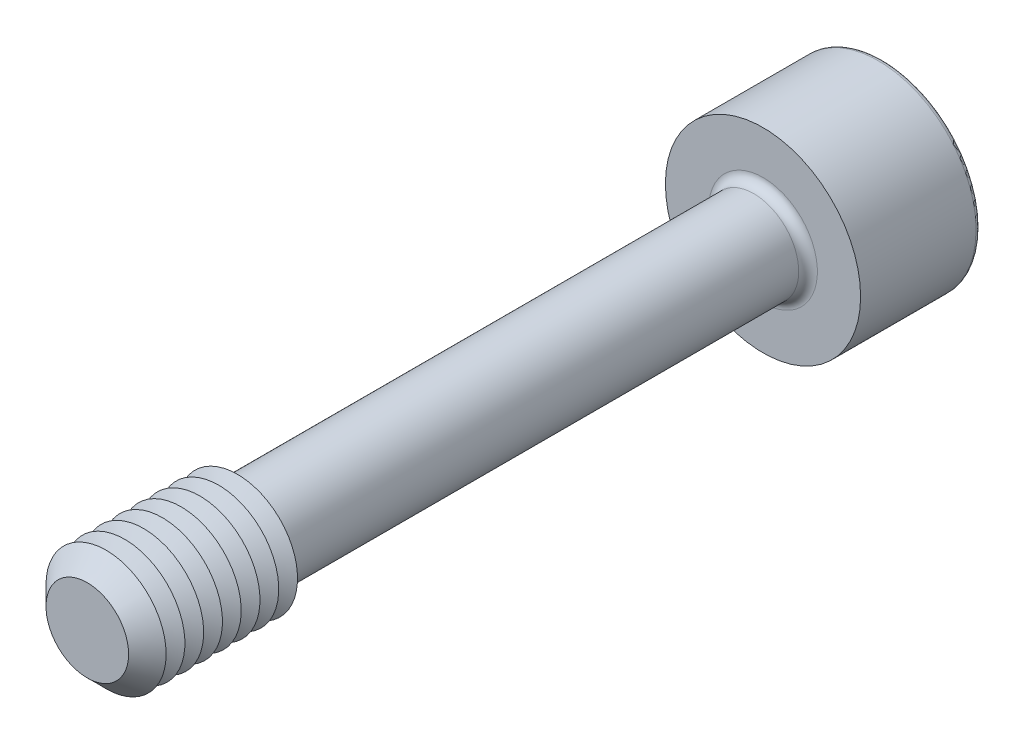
ISO-10303-21;
HEADER;
FILE_DESCRIPTION(('STEP AP214'),'2;1');
FILE_NAME('part.step','',(''),(''),'','','');
FILE_SCHEMA(('AUTOMOTIVE_DESIGN { 1 0 10303 214 1 1 1 1 }'));
ENDSEC;
DATA;
#1=APPLICATION_CONTEXT('core data for automotive mechanical design processes');
#2=APPLICATION_PROTOCOL_DEFINITION('international standard','automotive_design',2000,#1);
#3=PRODUCT_CONTEXT('',#1,'mechanical');
#4=PRODUCT('Part','Part','',(#3));
#5=PRODUCT_RELATED_PRODUCT_CATEGORY('part','',(#4));
#6=PRODUCT_DEFINITION_FORMATION('','',#4);
#7=PRODUCT_DEFINITION_CONTEXT('part definition',#1,'design');
#8=PRODUCT_DEFINITION('design','',#6,#7);
#9=PRODUCT_DEFINITION_SHAPE('','',#8);
#10=(LENGTH_UNIT() NAMED_UNIT(*) SI_UNIT(.MILLI.,.METRE.));
#11=(NAMED_UNIT(*) PLANE_ANGLE_UNIT() SI_UNIT($,.RADIAN.));
#12=(NAMED_UNIT(*) SI_UNIT($,.STERADIAN.) SOLID_ANGLE_UNIT());
#13=UNCERTAINTY_MEASURE_WITH_UNIT(LENGTH_MEASURE(1.E-05),#10,'distance_accuracy_value','');
#14=(GEOMETRIC_REPRESENTATION_CONTEXT(3) GLOBAL_UNCERTAINTY_ASSIGNED_CONTEXT((#13)) GLOBAL_UNIT_ASSIGNED_CONTEXT((#10,
#11,#12)) REPRESENTATION_CONTEXT('',''));
#15=CARTESIAN_POINT('',(0.,0.,0.));
#16=DIRECTION('',(0.,0.,1.));
#17=DIRECTION('',(1.,0.,0.));
#18=AXIS2_PLACEMENT_3D('',#15,#16,#17);
#19=CARTESIAN_POINT('',(-1.73205080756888,-3.,-24.5));
#20=DIRECTION('',(0.,0.,1.));
#21=DIRECTION('',(1.,0.,0.));
#22=AXIS2_PLACEMENT_3D('',#19,#20,#21);
#23=PLANE('',#22);
#24=DIRECTION('',(1.,0.,0.));
#25=VECTOR('',#24,1.);
#26=CARTESIAN_POINT('',(-1.73205080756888,-3.,-24.5));
#27=LINE('',#26,#25);
#28=CARTESIAN_POINT('',(0.,-3.,-24.5));
#29=VERTEX_POINT('',#28);
#30=CARTESIAN_POINT('',(1.73205080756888,-3.,-24.5));
#31=VERTEX_POINT('',#30);
#32=EDGE_CURVE('E406',#29,#31,#27,.T.);
#33=ORIENTED_EDGE('',*,*,#32,.F.);
#34=CARTESIAN_POINT('',(0.,0.,-24.5));
#35=DIRECTION('',(0.,0.,1.));
#36=DIRECTION('',(0.,-1.,0.));
#37=AXIS2_PLACEMENT_3D('',#34,#35,#36);
#38=CIRCLE('',#37,3.);
#39=CARTESIAN_POINT('',(2.59807621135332,-1.5,-24.5));
#40=VERTEX_POINT('',#39);
#41=EDGE_CURVE('E53',#29,#40,#38,.T.);
#42=ORIENTED_EDGE('',*,*,#41,.T.);
#43=DIRECTION('',(0.5,0.866025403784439,0.));
#44=VECTOR('',#43,1.);
#45=CARTESIAN_POINT('',(1.73205080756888,-3.,-24.5));
#46=LINE('',#45,#44);
#47=EDGE_CURVE('E396',#31,#40,#46,.T.);
#48=ORIENTED_EDGE('',*,*,#47,.F.);
#49=EDGE_LOOP('',(#33,#42,#48));
#50=FACE_BOUND('',#49,.T.);
#51=ADVANCED_FACE('F41',(#50),#23,.F.);
#52=CARTESIAN_POINT('',(3.46410161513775,0.,-24.5));
#53=VERTEX_POINT('',#52);
#54=EDGE_CURVE('E401',#40,#53,#46,.T.);
#55=ORIENTED_EDGE('',*,*,#54,.F.);
#56=CARTESIAN_POINT('',(2.59807621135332,1.5,-24.5));
#57=VERTEX_POINT('',#56);
#58=EDGE_CURVE('E11',#40,#57,#38,.T.);
#59=ORIENTED_EDGE('',*,*,#58,.T.);
#60=DIRECTION('',(-0.5,0.866025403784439,0.));
#61=VECTOR('',#60,1.);
#62=CARTESIAN_POINT('',(3.46410161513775,0.,-24.5));
#63=LINE('',#62,#61);
#64=EDGE_CURVE('E392',#53,#57,#63,.T.);
#65=ORIENTED_EDGE('',*,*,#64,.F.);
#66=EDGE_LOOP('',(#55,#59,#65));
#67=FACE_BOUND('',#66,.T.);
#68=ADVANCED_FACE('F133',(#67),#23,.F.);
#69=CARTESIAN_POINT('',(1.73205080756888,3.,-24.5));
#70=VERTEX_POINT('',#69);
#71=EDGE_CURVE('E391',#57,#70,#63,.T.);
#72=ORIENTED_EDGE('',*,*,#71,.F.);
#73=CARTESIAN_POINT('',(0.,3.,-24.5));
#74=VERTEX_POINT('',#73);
#75=EDGE_CURVE('E51',#57,#74,#38,.T.);
#76=ORIENTED_EDGE('',*,*,#75,.T.);
#77=DIRECTION('',(-1.,0.,0.));
#78=VECTOR('',#77,1.);
#79=CARTESIAN_POINT('',(1.73205080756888,3.,-24.5));
#80=LINE('',#79,#78);
#81=EDGE_CURVE('E177',#70,#74,#80,.T.);
#82=ORIENTED_EDGE('',*,*,#81,.F.);
#83=EDGE_LOOP('',(#72,#76,#82));
#84=FACE_BOUND('',#83,.T.);
#85=ADVANCED_FACE('F139',(#84),#23,.F.);
#86=CARTESIAN_POINT('',(-1.73205080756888,3.,-24.5));
#87=VERTEX_POINT('',#86);
#88=EDGE_CURVE('E399',#74,#87,#80,.T.);
#89=ORIENTED_EDGE('',*,*,#88,.F.);
#90=CARTESIAN_POINT('',(-2.59807621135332,1.5,-24.5));
#91=VERTEX_POINT('',#90);
#92=EDGE_CURVE('E264',#74,#91,#38,.T.);
#93=ORIENTED_EDGE('',*,*,#92,.T.);
#94=DIRECTION('',(-0.5,-0.866025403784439,0.));
#95=VECTOR('',#94,1.);
#96=CARTESIAN_POINT('',(-1.73205080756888,3.,-24.5));
#97=LINE('',#96,#95);
#98=EDGE_CURVE('E176',#87,#91,#97,.T.);
#99=ORIENTED_EDGE('',*,*,#98,.F.);
#100=EDGE_LOOP('',(#89,#93,#99));
#101=FACE_BOUND('',#100,.T.);
#102=ADVANCED_FACE('F157',(#101),#23,.F.);
#103=CARTESIAN_POINT('',(-3.46410161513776,0.,-24.5));
#104=VERTEX_POINT('',#103);
#105=EDGE_CURVE('E170',#91,#104,#97,.T.);
#106=ORIENTED_EDGE('',*,*,#105,.F.);
#107=CARTESIAN_POINT('',(-2.59807621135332,-1.5,-24.5));
#108=VERTEX_POINT('',#107);
#109=EDGE_CURVE('E172',#91,#108,#38,.T.);
#110=ORIENTED_EDGE('',*,*,#109,.T.);
#111=DIRECTION('',(0.5,-0.866025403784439,0.));
#112=VECTOR('',#111,1.);
#113=CARTESIAN_POINT('',(-3.46410161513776,0.,-24.5));
#114=LINE('',#113,#112);
#115=EDGE_CURVE('E174',#104,#108,#114,.T.);
#116=ORIENTED_EDGE('',*,*,#115,.F.);
#117=EDGE_LOOP('',(#106,#110,#116));
#118=FACE_BOUND('',#117,.T.);
#119=ADVANCED_FACE('F146',(#118),#23,.F.);
#120=CARTESIAN_POINT('',(0.,0.,-30.5));
#121=DIRECTION('',(0.,0.,-1.));
#122=DIRECTION('',(-1.,0.,0.));
#123=AXIS2_PLACEMENT_3D('',#120,#121,#122);
#124=PLANE('',#123);
#125=CARTESIAN_POINT('',(0.,0.,-30.5));
#126=DIRECTION('',(0.,0.,-1.));
#127=DIRECTION('',(-1.,0.,0.));
#128=AXIS2_PLACEMENT_3D('',#125,#126,#127);
#129=CIRCLE('',#128,6.19);
#130=CARTESIAN_POINT('',(-6.19,0.,-30.5));
#131=VERTEX_POINT('',#130);
#132=EDGE_CURVE('E250',#131,#131,#129,.T.);
#133=ORIENTED_EDGE('',*,*,#132,.T.);
#134=EDGE_LOOP('',(#133));
#135=FACE_BOUND('',#134,.T.);
#136=DIRECTION('',(-0.5,-0.866025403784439,0.));
#137=VECTOR('',#136,1.);
#138=CARTESIAN_POINT('',(-1.73205080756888,3.,-30.5));
#139=LINE('',#138,#137);
#140=CARTESIAN_POINT('',(-1.73205080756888,3.,-30.5));
#141=VERTEX_POINT('',#140);
#142=CARTESIAN_POINT('',(-3.46410161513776,0.,-30.5));
#143=VERTEX_POINT('',#142);
#144=EDGE_CURVE('E212',#141,#143,#139,.T.);
#145=ORIENTED_EDGE('',*,*,#144,.T.);
#146=DIRECTION('',(0.5,-0.866025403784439,0.));
#147=VECTOR('',#146,1.);
#148=CARTESIAN_POINT('',(-3.46410161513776,0.,-30.5));
#149=LINE('',#148,#147);
#150=CARTESIAN_POINT('',(-1.73205080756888,-3.,-30.5));
#151=VERTEX_POINT('',#150);
#152=EDGE_CURVE('E67',#143,#151,#149,.T.);
#153=ORIENTED_EDGE('',*,*,#152,.T.);
#154=DIRECTION('',(1.,0.,0.));
#155=VECTOR('',#154,1.);
#156=CARTESIAN_POINT('',(-1.73205080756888,-3.,-30.5));
#157=LINE('',#156,#155);
#158=CARTESIAN_POINT('',(1.73205080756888,-3.,-30.5));
#159=VERTEX_POINT('',#158);
#160=EDGE_CURVE('E196',#151,#159,#157,.T.);
#161=ORIENTED_EDGE('',*,*,#160,.T.);
#162=DIRECTION('',(0.5,0.866025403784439,0.));
#163=VECTOR('',#162,1.);
#164=CARTESIAN_POINT('',(1.73205080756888,-3.,-30.5));
#165=LINE('',#164,#163);
#166=CARTESIAN_POINT('',(3.46410161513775,0.,-30.5));
#167=VERTEX_POINT('',#166);
#168=EDGE_CURVE('E200',#159,#167,#165,.T.);
#169=ORIENTED_EDGE('',*,*,#168,.T.);
#170=DIRECTION('',(-0.5,0.866025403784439,0.));
#171=VECTOR('',#170,1.);
#172=CARTESIAN_POINT('',(3.46410161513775,0.,-30.5));
#173=LINE('',#172,#171);
#174=CARTESIAN_POINT('',(1.73205080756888,3.,-30.5));
#175=VERTEX_POINT('',#174);
#176=EDGE_CURVE('E204',#167,#175,#173,.T.);
#177=ORIENTED_EDGE('',*,*,#176,.T.);
#178=DIRECTION('',(-1.,0.,0.));
#179=VECTOR('',#178,1.);
#180=CARTESIAN_POINT('',(1.73205080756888,3.,-30.5));
#181=LINE('',#180,#179);
#182=EDGE_CURVE('E208',#175,#141,#181,.T.);
#183=ORIENTED_EDGE('',*,*,#182,.T.);
#184=EDGE_LOOP('',(#145,#153,#161,#169,#177,#183));
#185=FACE_BOUND('',#184,.T.);
#186=ADVANCED_FACE('F156',(#135,#185),#124,.T.);
#187=CARTESIAN_POINT('',(0.,0.,22.5));
#188=DIRECTION('',(0.,0.,-1.));
#189=DIRECTION('',(-1.,0.,0.));
#190=AXIS2_PLACEMENT_3D('',#187,#188,#189);
#191=CYLINDRICAL_SURFACE('',#190,3.);
#192=CARTESIAN_POINT('',(0.,0.,-21.88));
#193=DIRECTION('',(0.,0.,-1.));
#194=DIRECTION('',(-1.,0.,0.));
#195=AXIS2_PLACEMENT_3D('',#192,#193,#194);
#196=CIRCLE('',#195,3.);
#197=CARTESIAN_POINT('',(-3.,0.,-21.88));
#198=VERTEX_POINT('',#197);
#199=EDGE_CURVE('E247',#198,#198,#196,.F.);
#200=CARTESIAN_POINT('',(0.,0.,11.9226497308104));
#201=DIRECTION('',(0.,0.,-1.));
#202=DIRECTION('',(0.,1.,0.));
#203=AXIS2_PLACEMENT_3D('',#200,#201,#202);
#204=CIRCLE('',#203,3.);
#205=CARTESIAN_POINT('',(-3.,0.,11.9226497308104));
#206=VERTEX_POINT('',#205);
#207=EDGE_CURVE('E235',#206,#206,#204,.T.);
#208=CARTESIAN_POINT('',(-3.,0.,-21.88));
#209=CARTESIAN_POINT('',(-3.,0.,-21.5278890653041));
#210=CARTESIAN_POINT('',(-3.,0.,-21.1757781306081));
#211=CARTESIAN_POINT('',(-3.,0.,-20.4715562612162));
#212=CARTESIAN_POINT('',(-3.,0.,-20.1194453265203));
#213=CARTESIAN_POINT('',(-3.,0.,-19.4152234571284));
#214=CARTESIAN_POINT('',(-3.,0.,-19.0631125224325));
#215=CARTESIAN_POINT('',(-3.,0.,-18.3588906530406));
#216=CARTESIAN_POINT('',(-3.,0.,-18.0067797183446));
#217=CARTESIAN_POINT('',(-3.,0.,-17.3025578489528));
#218=CARTESIAN_POINT('',(-3.,0.,-16.9504469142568));
#219=CARTESIAN_POINT('',(-3.,0.,-16.2462250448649));
#220=CARTESIAN_POINT('',(-3.,0.,-15.894114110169));
#221=CARTESIAN_POINT('',(-3.,0.,-15.1898922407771));
#222=CARTESIAN_POINT('',(-3.,0.,-14.8377813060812));
#223=CARTESIAN_POINT('',(-3.,0.,-14.1335594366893));
#224=CARTESIAN_POINT('',(-3.,0.,-13.7814485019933));
#225=CARTESIAN_POINT('',(-3.,0.,-13.0772266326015));
#226=CARTESIAN_POINT('',(-3.,0.,-12.7251156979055));
#227=CARTESIAN_POINT('',(-3.,0.,-12.0208938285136));
#228=CARTESIAN_POINT('',(-3.,0.,-11.6687828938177));
#229=CARTESIAN_POINT('',(-3.,0.,-10.9645610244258));
#230=CARTESIAN_POINT('',(-3.,0.,-10.6124500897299));
#231=CARTESIAN_POINT('',(-3.,0.,-9.90822822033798));
#232=CARTESIAN_POINT('',(-3.,0.,-9.55611728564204));
#233=CARTESIAN_POINT('',(-3.,0.,-8.85189541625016));
#234=CARTESIAN_POINT('',(-3.,0.,-8.49978448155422));
#235=CARTESIAN_POINT('',(-3.,0.,-7.79556261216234));
#236=CARTESIAN_POINT('',(-3.,0.,-7.4434516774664));
#237=CARTESIAN_POINT('',(-3.,0.,-6.73922980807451));
#238=CARTESIAN_POINT('',(-3.,0.,-6.38711887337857));
#239=CARTESIAN_POINT('',(-3.,0.,-5.68289700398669));
#240=CARTESIAN_POINT('',(-3.,0.,-5.33078606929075));
#241=CARTESIAN_POINT('',(-3.,0.,-4.62656419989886));
#242=CARTESIAN_POINT('',(-3.,0.,-4.27445326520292));
#243=CARTESIAN_POINT('',(-3.,0.,-3.57023139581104));
#244=CARTESIAN_POINT('',(-3.,0.,-3.2181204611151));
#245=CARTESIAN_POINT('',(-3.,0.,-2.51389859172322));
#246=CARTESIAN_POINT('',(-3.,0.,-2.16178765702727));
#247=CARTESIAN_POINT('',(-3.,0.,-1.45756578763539));
#248=CARTESIAN_POINT('',(-3.,0.,-1.10545485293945));
#249=CARTESIAN_POINT('',(-3.,0.,-0.401232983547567));
#250=CARTESIAN_POINT('',(-3.,0.,-0.0491220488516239));
#251=CARTESIAN_POINT('',(-3.,0.,0.65509982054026));
#252=CARTESIAN_POINT('',(-3.,0.,1.0072107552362));
#253=CARTESIAN_POINT('',(-3.,0.,1.71143262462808));
#254=CARTESIAN_POINT('',(-3.,0.,2.06354355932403));
#255=CARTESIAN_POINT('',(-3.,0.,2.76776542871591));
#256=CARTESIAN_POINT('',(-3.,0.,3.11987636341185));
#257=CARTESIAN_POINT('',(-3.,0.,3.82409823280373));
#258=CARTESIAN_POINT('',(-3.,0.,4.17620916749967));
#259=CARTESIAN_POINT('',(-3.,0.,4.88043103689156));
#260=CARTESIAN_POINT('',(-3.,0.,5.2325419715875));
#261=CARTESIAN_POINT('',(-3.,0.,5.93676384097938));
#262=CARTESIAN_POINT('',(-3.,0.,6.28887477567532));
#263=CARTESIAN_POINT('',(-3.,0.,6.99309664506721));
#264=CARTESIAN_POINT('',(-3.,0.,7.34520757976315));
#265=CARTESIAN_POINT('',(-3.,0.,8.04942944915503));
#266=CARTESIAN_POINT('',(-3.,0.,8.40154038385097));
#267=CARTESIAN_POINT('',(-3.,0.,9.10576225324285));
#268=CARTESIAN_POINT('',(-3.,0.,9.4578731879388));
#269=CARTESIAN_POINT('',(-3.,0.,10.1620950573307));
#270=CARTESIAN_POINT('',(-3.,0.,10.5142059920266));
#271=CARTESIAN_POINT('',(-3.,0.,11.2184278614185));
#272=CARTESIAN_POINT('',(-3.,0.,11.5705387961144));
#273=CARTESIAN_POINT('',(-3.,0.,11.9226497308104));
#274=B_SPLINE_CURVE_WITH_KNOTS('',3,(#208,#209,#210,#211,#212,#213,#214,#215,#216,#217,#218,
#219,#220,#221,#222,#223,#224,#225,#226,#227,#228,#229,#230,#231,#232,#233,#234,#235,#236,#237,
#238,#239,#240,#241,#242,#243,#244,#245,#246,#247,#248,#249,#250,#251,#252,#253,#254,#255,#256,
#257,#258,#259,#260,#261,#262,#263,#264,#265,#266,#267,#268,#269,#270,#271,#272,#273),
.UNSPECIFIED.,.F.,.F.,(4,2,2,2,2,2,2,2,2,2,2,2,2,2,2,2,2,2,2,2,2,2,2,2,2,2,2,2,2,2,2,2,4),(0.,
1.05633280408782,2.11266560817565,3.16899841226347,4.2253312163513,5.28166402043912,
6.33799682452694,7.39432962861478,8.45066243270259,9.50699523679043,10.5633280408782,
11.6196608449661,12.6759936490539,13.7323264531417,14.7886592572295,15.8449920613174,
16.9013248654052,17.957657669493,19.0139904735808,20.0703232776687,21.1266560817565,
22.1829888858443,23.2393216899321,24.29565449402,25.3519872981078,26.4083201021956,
27.4646529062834,28.5209857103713,29.5773185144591,30.6336513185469,31.6899841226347,
32.7463169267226,33.8026497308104),.UNSPECIFIED.);
#275=EDGE_CURVE('BSEAM163',#198,#206,#274,.T.);
#276=ORIENTED_EDGE('',*,*,#199,.T.);
#277=ORIENTED_EDGE('',*,*,#207,.T.);
#278=ORIENTED_EDGE('',*,*,#275,.T.);
#279=ORIENTED_EDGE('',*,*,#275,.F.);
#280=EDGE_LOOP('',(#276,#278,#277,#279));
#281=FACE_BOUND('',#280,.T.);
#282=ADVANCED_FACE('F163',(#281),#191,.T.);
#283=CARTESIAN_POINT('',(0.,0.,11.9226497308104));
#284=DIRECTION('',(0.,0.,1.));
#285=DIRECTION('',(0.,-1.,0.));
#286=AXIS2_PLACEMENT_3D('',#283,#284,#285);
#287=CONICAL_SURFACE('',#286,3.,1.04719755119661);
#288=CARTESIAN_POINT('',(0.,0.,12.5));
#289=DIRECTION('',(0.,0.,-1.));
#290=DIRECTION('',(-1.,0.,0.));
#291=AXIS2_PLACEMENT_3D('',#288,#289,#290);
#292=CIRCLE('',#291,4.);
#293=CARTESIAN_POINT('',(-4.,0.,12.5));
#294=VERTEX_POINT('',#293);
#295=EDGE_CURVE('E268',#294,#294,#292,.T.);
#296=ORIENTED_EDGE('',*,*,#295,.T.);
#297=EDGE_LOOP('',(#296));
#298=FACE_BOUND('',#297,.T.);
#299=ORIENTED_EDGE('',*,*,#207,.F.);
#300=EDGE_LOOP('',(#299));
#301=FACE_BOUND('',#300,.T.);
#302=ADVANCED_FACE('F349',(#298,#301),#287,.T.);
#303=CARTESIAN_POINT('',(0.,0.,-22.5));
#304=DIRECTION('',(0.,0.,-1.));
#305=DIRECTION('',(-1.,0.,0.));
#306=AXIS2_PLACEMENT_3D('',#303,#304,#305);
#307=PLANE('',#306);
#308=CARTESIAN_POINT('',(0.,0.,-22.5));
#309=DIRECTION('',(0.,0.,-1.));
#310=DIRECTION('',(-1.,0.,0.));
#311=AXIS2_PLACEMENT_3D('',#308,#309,#310);
#312=CIRCLE('',#311,3.62);
#313=CARTESIAN_POINT('',(-3.62,0.,-22.5));
#314=VERTEX_POINT('',#313);
#315=EDGE_CURVE('E243',#314,#314,#312,.T.);
#316=ORIENTED_EDGE('',*,*,#315,.T.);
#317=EDGE_LOOP('',(#316));
#318=FACE_BOUND('',#317,.T.);
#319=CARTESIAN_POINT('',(0.,0.,-22.5));
#320=DIRECTION('',(0.,0.,-1.));
#321=DIRECTION('',(-1.,0.,0.));
#322=AXIS2_PLACEMENT_3D('',#319,#320,#321);
#323=CIRCLE('',#322,6.5);
#324=CARTESIAN_POINT('',(-6.5,0.,-22.5));
#325=VERTEX_POINT('',#324);
#326=EDGE_CURVE('E231',#325,#325,#323,.T.);
#327=ORIENTED_EDGE('',*,*,#326,.F.);
#328=EDGE_LOOP('',(#327));
#329=FACE_BOUND('',#328,.T.);
#330=ADVANCED_FACE('F354',(#318,#329),#307,.F.);
#331=CARTESIAN_POINT('',(0.,0.,-30.5));
#332=DIRECTION('',(0.,0.,1.));
#333=DIRECTION('',(1.,0.,0.));
#334=AXIS2_PLACEMENT_3D('',#331,#332,#333);
#335=CYLINDRICAL_SURFACE('',#334,6.5);
#336=CARTESIAN_POINT('',(0.,0.,-30.19));
#337=DIRECTION('',(0.,0.,-1.));
#338=DIRECTION('',(-1.,0.,0.));
#339=AXIS2_PLACEMENT_3D('',#336,#337,#338);
#340=CIRCLE('',#339,6.5);
#341=CARTESIAN_POINT('',(-6.5,0.,-30.19));
#342=VERTEX_POINT('',#341);
#343=EDGE_CURVE('E45',#342,#342,#340,.F.);
#344=ORIENTED_EDGE('',*,*,#343,.T.);
#345=EDGE_LOOP('',(#344));
#346=FACE_BOUND('',#345,.T.);
#347=ORIENTED_EDGE('',*,*,#326,.T.);
#348=EDGE_LOOP('',(#347));
#349=FACE_BOUND('',#348,.T.);
#350=ADVANCED_FACE('F355',(#346,#349),#335,.T.);
#351=CARTESIAN_POINT('',(-3.46410161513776,0.,-24.5));
#352=DIRECTION('',(0.866025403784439,0.5,0.));
#353=DIRECTION('',(-0.5,0.866025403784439,0.));
#354=AXIS2_PLACEMENT_3D('',#351,#352,#353);
#355=PLANE('',#354);
#356=ORIENTED_EDGE('',*,*,#152,.F.);
#357=DIRECTION('',(0.,0.,-1.));
#358=VECTOR('',#357,1.);
#359=CARTESIAN_POINT('',(-3.46410161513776,0.,-24.5));
#360=LINE('',#359,#358);
#361=EDGE_CURVE('E186',#104,#143,#360,.T.);
#362=ORIENTED_EDGE('',*,*,#361,.F.);
#363=ORIENTED_EDGE('',*,*,#115,.T.);
#364=CARTESIAN_POINT('',(-1.73205080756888,-3.,-24.5));
#365=VERTEX_POINT('',#364);
#366=EDGE_CURVE('E215',#108,#365,#114,.T.);
#367=ORIENTED_EDGE('',*,*,#366,.T.);
#368=DIRECTION('',(0.,0.,-1.));
#369=VECTOR('',#368,1.);
#370=CARTESIAN_POINT('',(-1.73205080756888,-3.,-24.5));
#371=LINE('',#370,#369);
#372=EDGE_CURVE('E228',#365,#151,#371,.T.);
#373=ORIENTED_EDGE('',*,*,#372,.T.);
#374=EDGE_LOOP('',(#356,#362,#363,#367,#373));
#375=FACE_BOUND('',#374,.T.);
#376=ADVANCED_FACE('F358',(#375),#355,.T.);
#377=CARTESIAN_POINT('',(-1.73205080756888,-3.,-24.5));
#378=DIRECTION('',(0.,1.,0.));
#379=DIRECTION('',(0.,0.,1.));
#380=AXIS2_PLACEMENT_3D('',#377,#378,#379);
#381=PLANE('',#380);
#382=ORIENTED_EDGE('',*,*,#160,.F.);
#383=ORIENTED_EDGE('',*,*,#372,.F.);
#384=EDGE_CURVE('E404',#365,#29,#27,.T.);
#385=ORIENTED_EDGE('',*,*,#384,.T.);
#386=ORIENTED_EDGE('',*,*,#32,.T.);
#387=DIRECTION('',(0.,0.,-1.));
#388=VECTOR('',#387,1.);
#389=CARTESIAN_POINT('',(1.73205080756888,-3.,-24.5));
#390=LINE('',#389,#388);
#391=EDGE_CURVE('E225',#31,#159,#390,.T.);
#392=ORIENTED_EDGE('',*,*,#391,.T.);
#393=EDGE_LOOP('',(#382,#383,#385,#386,#392));
#394=FACE_BOUND('',#393,.T.);
#395=ADVANCED_FACE('F364',(#394),#381,.T.);
#396=CARTESIAN_POINT('',(1.73205080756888,-3.,-24.5));
#397=DIRECTION('',(-0.866025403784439,0.5,0.));
#398=DIRECTION('',(-0.5,-0.866025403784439,0.));
#399=AXIS2_PLACEMENT_3D('',#396,#397,#398);
#400=PLANE('',#399);
#401=ORIENTED_EDGE('',*,*,#168,.F.);
#402=ORIENTED_EDGE('',*,*,#391,.F.);
#403=ORIENTED_EDGE('',*,*,#47,.T.);
#404=ORIENTED_EDGE('',*,*,#54,.T.);
#405=DIRECTION('',(0.,0.,-1.));
#406=VECTOR('',#405,1.);
#407=CARTESIAN_POINT('',(3.46410161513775,0.,-24.5));
#408=LINE('',#407,#406);
#409=EDGE_CURVE('E222',#53,#167,#408,.T.);
#410=ORIENTED_EDGE('',*,*,#409,.T.);
#411=EDGE_LOOP('',(#401,#402,#403,#404,#410));
#412=FACE_BOUND('',#411,.T.);
#413=ADVANCED_FACE('F367',(#412),#400,.T.);
#414=CARTESIAN_POINT('',(3.46410161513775,0.,-24.5));
#415=DIRECTION('',(-0.866025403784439,-0.5,0.));
#416=DIRECTION('',(0.5,-0.866025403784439,0.));
#417=AXIS2_PLACEMENT_3D('',#414,#415,#416);
#418=PLANE('',#417);
#419=ORIENTED_EDGE('',*,*,#176,.F.);
#420=ORIENTED_EDGE('',*,*,#409,.F.);
#421=ORIENTED_EDGE('',*,*,#64,.T.);
#422=ORIENTED_EDGE('',*,*,#71,.T.);
#423=DIRECTION('',(0.,0.,-1.));
#424=VECTOR('',#423,1.);
#425=CARTESIAN_POINT('',(1.73205080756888,3.,-24.5));
#426=LINE('',#425,#424);
#427=EDGE_CURVE('E219',#70,#175,#426,.T.);
#428=ORIENTED_EDGE('',*,*,#427,.T.);
#429=EDGE_LOOP('',(#419,#420,#421,#422,#428));
#430=FACE_BOUND('',#429,.T.);
#431=ADVANCED_FACE('F371',(#430),#418,.T.);
#432=CARTESIAN_POINT('',(1.73205080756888,3.,-24.5));
#433=DIRECTION('',(0.,-1.,0.));
#434=DIRECTION('',(1.,0.,0.));
#435=AXIS2_PLACEMENT_3D('',#432,#433,#434);
#436=PLANE('',#435);
#437=ORIENTED_EDGE('',*,*,#182,.F.);
#438=ORIENTED_EDGE('',*,*,#427,.F.);
#439=ORIENTED_EDGE('',*,*,#81,.T.);
#440=ORIENTED_EDGE('',*,*,#88,.T.);
#441=DIRECTION('',(0.,0.,-1.));
#442=VECTOR('',#441,1.);
#443=CARTESIAN_POINT('',(-1.73205080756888,3.,-24.5));
#444=LINE('',#443,#442);
#445=EDGE_CURVE('E182',#87,#141,#444,.T.);
#446=ORIENTED_EDGE('',*,*,#445,.T.);
#447=EDGE_LOOP('',(#437,#438,#439,#440,#446));
#448=FACE_BOUND('',#447,.T.);
#449=ADVANCED_FACE('F152',(#448),#436,.T.);
#450=CARTESIAN_POINT('',(-1.73205080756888,3.,-24.5));
#451=DIRECTION('',(0.866025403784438,-0.5,0.));
#452=DIRECTION('',(0.5,0.866025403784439,0.));
#453=AXIS2_PLACEMENT_3D('',#450,#451,#452);
#454=PLANE('',#453);
#455=ORIENTED_EDGE('',*,*,#144,.F.);
#456=ORIENTED_EDGE('',*,*,#445,.F.);
#457=ORIENTED_EDGE('',*,*,#98,.T.);
#458=ORIENTED_EDGE('',*,*,#105,.T.);
#459=ORIENTED_EDGE('',*,*,#361,.T.);
#460=EDGE_LOOP('',(#455,#456,#457,#458,#459));
#461=FACE_BOUND('',#460,.T.);
#462=ADVANCED_FACE('F144',(#461),#454,.T.);
#463=ORIENTED_EDGE('',*,*,#366,.F.);
#464=EDGE_CURVE('E255',#108,#29,#38,.T.);
#465=ORIENTED_EDGE('',*,*,#464,.T.);
#466=ORIENTED_EDGE('',*,*,#384,.F.);
#467=EDGE_LOOP('',(#463,#465,#466));
#468=FACE_BOUND('',#467,.T.);
#469=ADVANCED_FACE('F135',(#468),#23,.F.);
#470=CARTESIAN_POINT('',(0.,0.,-21.88));
#471=DIRECTION('',(0.,0.,-1.));
#472=DIRECTION('',(-1.,0.,0.));
#473=AXIS2_PLACEMENT_3D('',#470,#471,#472);
#474=TOROIDAL_SURFACE('',#473,3.62,0.62);
#475=ORIENTED_EDGE('',*,*,#199,.F.);
#476=EDGE_LOOP('',(#475));
#477=FACE_BOUND('',#476,.T.);
#478=ORIENTED_EDGE('',*,*,#315,.F.);
#479=EDGE_LOOP('',(#478));
#480=FACE_BOUND('',#479,.T.);
#481=ADVANCED_FACE('F129',(#477,#480),#474,.F.);
#482=CARTESIAN_POINT('',(0.,0.,-30.19));
#483=DIRECTION('',(0.,0.,-1.));
#484=DIRECTION('',(-1.,0.,0.));
#485=AXIS2_PLACEMENT_3D('',#482,#483,#484);
#486=TOROIDAL_SURFACE('',#485,6.19,0.31);
#487=ORIENTED_EDGE('',*,*,#343,.F.);
#488=EDGE_LOOP('',(#487));
#489=FACE_BOUND('',#488,.T.);
#490=ORIENTED_EDGE('',*,*,#132,.F.);
#491=EDGE_LOOP('',(#490));
#492=FACE_BOUND('',#491,.T.);
#493=ADVANCED_FACE('F43',(#489,#492),#486,.T.);
#494=CARTESIAN_POINT('',(0.,0.,-22.7679491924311));
#495=DIRECTION('',(0.,0.,-1.));
#496=DIRECTION('',(0.,1.,0.));
#497=AXIS2_PLACEMENT_3D('',#494,#495,#496);
#498=CONICAL_SURFACE('',#497,0.,1.0471975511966);
#499=ORIENTED_EDGE('',*,*,#41,.F.);
#500=ORIENTED_EDGE('',*,*,#464,.F.);
#501=ORIENTED_EDGE('',*,*,#109,.F.);
#502=ORIENTED_EDGE('',*,*,#92,.F.);
#503=ORIENTED_EDGE('',*,*,#75,.F.);
#504=ORIENTED_EDGE('',*,*,#58,.F.);
#505=EDGE_LOOP('',(#499,#500,#501,#502,#503,#504));
#506=FACE_BOUND('',#505,.T.);
#507=CARTESIAN_POINT('',(0.,0.,-22.7679491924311));
#508=VERTEX_POINT('',#507);
#509=VERTEX_LOOP('',#508);
#510=FACE_BOUND('',#509,.T.);
#511=ADVANCED_FACE('F118',(#506,#510),#498,.F.);
#512=CARTESIAN_POINT('',(0.,0.,13.125));
#513=DIRECTION('',(0.,0.,-1.));
#514=DIRECTION('',(-1.,0.,0.));
#515=AXIS2_PLACEMENT_3D('',#512,#513,#514);
#516=CONICAL_SURFACE('',#515,2.91746824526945,1.0471975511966);
#517=ORIENTED_EDGE('',*,*,#295,.F.);
#518=EDGE_LOOP('',(#517));
#519=FACE_BOUND('',#518,.T.);
#520=CARTESIAN_POINT('',(0.,0.,13.125));
#521=DIRECTION('',(0.,0.,-1.));
#522=DIRECTION('',(-1.,0.,0.));
#523=AXIS2_PLACEMENT_3D('',#520,#521,#522);
#524=CIRCLE('',#523,2.91746824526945);
#525=CARTESIAN_POINT('',(-2.91746824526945,0.,13.125));
#526=VERTEX_POINT('',#525);
#527=EDGE_CURVE('E274',#526,#526,#524,.T.);
#528=ORIENTED_EDGE('',*,*,#527,.T.);
#529=EDGE_LOOP('',(#528));
#530=FACE_BOUND('',#529,.T.);
#531=ADVANCED_FACE('F120',(#519,#530),#516,.T.);
#532=CARTESIAN_POINT('',(0.,0.,13.75));
#533=DIRECTION('',(0.,0.,1.));
#534=DIRECTION('',(1.,0.,0.));
#535=AXIS2_PLACEMENT_3D('',#532,#533,#534);
#536=CONICAL_SURFACE('',#535,4.,1.0471975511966);
#537=ORIENTED_EDGE('',*,*,#527,.F.);
#538=EDGE_LOOP('',(#537));
#539=FACE_BOUND('',#538,.T.);
#540=CARTESIAN_POINT('',(0.,0.,13.75));
#541=DIRECTION('',(0.,0.,-1.));
#542=DIRECTION('',(-1.,0.,0.));
#543=AXIS2_PLACEMENT_3D('',#540,#541,#542);
#544=CIRCLE('',#543,4.);
#545=CARTESIAN_POINT('',(-4.,0.,13.75));
#546=VERTEX_POINT('',#545);
#547=EDGE_CURVE('E279',#546,#546,#544,.T.);
#548=ORIENTED_EDGE('',*,*,#547,.T.);
#549=EDGE_LOOP('',(#548));
#550=FACE_BOUND('',#549,.T.);
#551=ADVANCED_FACE('F126',(#539,#550),#536,.T.);
#552=CARTESIAN_POINT('',(0.,0.,14.375));
#553=DIRECTION('',(0.,0.,-1.));
#554=DIRECTION('',(-1.,0.,0.));
#555=AXIS2_PLACEMENT_3D('',#552,#553,#554);
#556=CONICAL_SURFACE('',#555,2.91746824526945,1.0471975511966);
#557=ORIENTED_EDGE('',*,*,#547,.F.);
#558=EDGE_LOOP('',(#557));
#559=FACE_BOUND('',#558,.T.);
#560=CARTESIAN_POINT('',(0.,0.,14.375));
#561=DIRECTION('',(0.,0.,-1.));
#562=DIRECTION('',(-1.,0.,0.));
#563=AXIS2_PLACEMENT_3D('',#560,#561,#562);
#564=CIRCLE('',#563,2.91746824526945);
#565=CARTESIAN_POINT('',(-2.91746824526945,0.,14.375));
#566=VERTEX_POINT('',#565);
#567=EDGE_CURVE('E285',#566,#566,#564,.T.);
#568=ORIENTED_EDGE('',*,*,#567,.T.);
#569=EDGE_LOOP('',(#568));
#570=FACE_BOUND('',#569,.T.);
#571=ADVANCED_FACE('F508',(#559,#570),#556,.T.);
#572=CARTESIAN_POINT('',(0.,0.,15.));
#573=DIRECTION('',(0.,0.,1.));
#574=DIRECTION('',(1.,0.,0.));
#575=AXIS2_PLACEMENT_3D('',#572,#573,#574);
#576=CONICAL_SURFACE('',#575,4.,1.0471975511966);
#577=ORIENTED_EDGE('',*,*,#567,.F.);
#578=EDGE_LOOP('',(#577));
#579=FACE_BOUND('',#578,.T.);
#580=CARTESIAN_POINT('',(0.,0.,15.));
#581=DIRECTION('',(0.,0.,-1.));
#582=DIRECTION('',(-1.,0.,0.));
#583=AXIS2_PLACEMENT_3D('',#580,#581,#582);
#584=CIRCLE('',#583,4.);
#585=CARTESIAN_POINT('',(-4.,0.,15.));
#586=VERTEX_POINT('',#585);
#587=EDGE_CURVE('E289',#586,#586,#584,.T.);
#588=ORIENTED_EDGE('',*,*,#587,.T.);
#589=EDGE_LOOP('',(#588));
#590=FACE_BOUND('',#589,.T.);
#591=ADVANCED_FACE('F517',(#579,#590),#576,.T.);
#592=CARTESIAN_POINT('',(0.,0.,15.625));
#593=DIRECTION('',(0.,0.,-1.));
#594=DIRECTION('',(-1.,0.,0.));
#595=AXIS2_PLACEMENT_3D('',#592,#593,#594);
#596=CONICAL_SURFACE('',#595,2.91746824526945,1.0471975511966);
#597=ORIENTED_EDGE('',*,*,#587,.F.);
#598=EDGE_LOOP('',(#597));
#599=FACE_BOUND('',#598,.T.);
#600=CARTESIAN_POINT('',(0.,0.,15.625));
#601=DIRECTION('',(0.,0.,-1.));
#602=DIRECTION('',(-1.,0.,0.));
#603=AXIS2_PLACEMENT_3D('',#600,#601,#602);
#604=CIRCLE('',#603,2.91746824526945);
#605=CARTESIAN_POINT('',(-2.91746824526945,0.,15.625));
#606=VERTEX_POINT('',#605);
#607=EDGE_CURVE('E293',#606,#606,#604,.T.);
#608=ORIENTED_EDGE('',*,*,#607,.T.);
#609=EDGE_LOOP('',(#608));
#610=FACE_BOUND('',#609,.T.);
#611=ADVANCED_FACE('F526',(#599,#610),#596,.T.);
#612=CARTESIAN_POINT('',(0.,0.,16.25));
#613=DIRECTION('',(0.,0.,1.));
#614=DIRECTION('',(1.,0.,0.));
#615=AXIS2_PLACEMENT_3D('',#612,#613,#614);
#616=CONICAL_SURFACE('',#615,4.,1.0471975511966);
#617=ORIENTED_EDGE('',*,*,#607,.F.);
#618=EDGE_LOOP('',(#617));
#619=FACE_BOUND('',#618,.T.);
#620=CARTESIAN_POINT('',(0.,0.,16.25));
#621=DIRECTION('',(0.,0.,-1.));
#622=DIRECTION('',(-1.,0.,0.));
#623=AXIS2_PLACEMENT_3D('',#620,#621,#622);
#624=CIRCLE('',#623,4.);
#625=CARTESIAN_POINT('',(-4.,0.,16.25));
#626=VERTEX_POINT('',#625);
#627=EDGE_CURVE('E297',#626,#626,#624,.T.);
#628=ORIENTED_EDGE('',*,*,#627,.T.);
#629=EDGE_LOOP('',(#628));
#630=FACE_BOUND('',#629,.T.);
#631=ADVANCED_FACE('F535',(#619,#630),#616,.T.);
#632=CARTESIAN_POINT('',(0.,0.,16.875));
#633=DIRECTION('',(0.,0.,-1.));
#634=DIRECTION('',(-1.,0.,0.));
#635=AXIS2_PLACEMENT_3D('',#632,#633,#634);
#636=CONICAL_SURFACE('',#635,2.91746824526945,1.0471975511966);
#637=ORIENTED_EDGE('',*,*,#627,.F.);
#638=EDGE_LOOP('',(#637));
#639=FACE_BOUND('',#638,.T.);
#640=CARTESIAN_POINT('',(0.,0.,16.875));
#641=DIRECTION('',(0.,0.,-1.));
#642=DIRECTION('',(-1.,0.,0.));
#643=AXIS2_PLACEMENT_3D('',#640,#641,#642);
#644=CIRCLE('',#643,2.91746824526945);
#645=CARTESIAN_POINT('',(-2.91746824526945,0.,16.875));
#646=VERTEX_POINT('',#645);
#647=EDGE_CURVE('E301',#646,#646,#644,.T.);
#648=ORIENTED_EDGE('',*,*,#647,.T.);
#649=EDGE_LOOP('',(#648));
#650=FACE_BOUND('',#649,.T.);
#651=ADVANCED_FACE('F544',(#639,#650),#636,.T.);
#652=CARTESIAN_POINT('',(0.,0.,17.5));
#653=DIRECTION('',(0.,0.,1.));
#654=DIRECTION('',(1.,0.,0.));
#655=AXIS2_PLACEMENT_3D('',#652,#653,#654);
#656=CONICAL_SURFACE('',#655,4.,1.0471975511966);
#657=ORIENTED_EDGE('',*,*,#647,.F.);
#658=EDGE_LOOP('',(#657));
#659=FACE_BOUND('',#658,.T.);
#660=CARTESIAN_POINT('',(0.,0.,17.5));
#661=DIRECTION('',(0.,0.,-1.));
#662=DIRECTION('',(-1.,0.,0.));
#663=AXIS2_PLACEMENT_3D('',#660,#661,#662);
#664=CIRCLE('',#663,4.);
#665=CARTESIAN_POINT('',(-4.,0.,17.5));
#666=VERTEX_POINT('',#665);
#667=EDGE_CURVE('E305',#666,#666,#664,.T.);
#668=ORIENTED_EDGE('',*,*,#667,.T.);
#669=EDGE_LOOP('',(#668));
#670=FACE_BOUND('',#669,.T.);
#671=ADVANCED_FACE('F553',(#659,#670),#656,.T.);
#672=CARTESIAN_POINT('',(0.,0.,18.125));
#673=DIRECTION('',(0.,0.,-1.));
#674=DIRECTION('',(-1.,0.,0.));
#675=AXIS2_PLACEMENT_3D('',#672,#673,#674);
#676=CONICAL_SURFACE('',#675,2.91746824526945,1.0471975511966);
#677=ORIENTED_EDGE('',*,*,#667,.F.);
#678=EDGE_LOOP('',(#677));
#679=FACE_BOUND('',#678,.T.);
#680=CARTESIAN_POINT('',(0.,0.,18.125));
#681=DIRECTION('',(0.,0.,-1.));
#682=DIRECTION('',(-1.,0.,0.));
#683=AXIS2_PLACEMENT_3D('',#680,#681,#682);
#684=CIRCLE('',#683,2.91746824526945);
#685=CARTESIAN_POINT('',(-2.91746824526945,0.,18.125));
#686=VERTEX_POINT('',#685);
#687=EDGE_CURVE('E309',#686,#686,#684,.T.);
#688=ORIENTED_EDGE('',*,*,#687,.T.);
#689=EDGE_LOOP('',(#688));
#690=FACE_BOUND('',#689,.T.);
#691=ADVANCED_FACE('F562',(#679,#690),#676,.T.);
#692=CARTESIAN_POINT('',(0.,0.,18.75));
#693=DIRECTION('',(0.,0.,1.));
#694=DIRECTION('',(1.,0.,0.));
#695=AXIS2_PLACEMENT_3D('',#692,#693,#694);
#696=CONICAL_SURFACE('',#695,4.,1.0471975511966);
#697=ORIENTED_EDGE('',*,*,#687,.F.);
#698=EDGE_LOOP('',(#697));
#699=FACE_BOUND('',#698,.T.);
#700=CARTESIAN_POINT('',(0.,0.,18.75));
#701=DIRECTION('',(0.,0.,-1.));
#702=DIRECTION('',(-1.,0.,0.));
#703=AXIS2_PLACEMENT_3D('',#700,#701,#702);
#704=CIRCLE('',#703,4.);
#705=CARTESIAN_POINT('',(-4.,0.,18.75));
#706=VERTEX_POINT('',#705);
#707=EDGE_CURVE('E312',#706,#706,#704,.T.);
#708=ORIENTED_EDGE('',*,*,#707,.T.);
#709=EDGE_LOOP('',(#708));
#710=FACE_BOUND('',#709,.T.);
#711=ADVANCED_FACE('F571',(#699,#710),#696,.T.);
#712=CARTESIAN_POINT('',(0.,0.,19.375));
#713=DIRECTION('',(0.,0.,-1.));
#714=DIRECTION('',(-1.,0.,0.));
#715=AXIS2_PLACEMENT_3D('',#712,#713,#714);
#716=CONICAL_SURFACE('',#715,2.91746824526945,1.0471975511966);
#717=ORIENTED_EDGE('',*,*,#707,.F.);
#718=EDGE_LOOP('',(#717));
#719=FACE_BOUND('',#718,.T.);
#720=CARTESIAN_POINT('',(0.,0.,19.375));
#721=DIRECTION('',(0.,0.,-1.));
#722=DIRECTION('',(-1.,0.,0.));
#723=AXIS2_PLACEMENT_3D('',#720,#721,#722);
#724=CIRCLE('',#723,2.91746824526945);
#725=CARTESIAN_POINT('',(-2.91746824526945,0.,19.375));
#726=VERTEX_POINT('',#725);
#727=EDGE_CURVE('E316',#726,#726,#724,.T.);
#728=ORIENTED_EDGE('',*,*,#727,.T.);
#729=EDGE_LOOP('',(#728));
#730=FACE_BOUND('',#729,.T.);
#731=ADVANCED_FACE('F580',(#719,#730),#716,.T.);
#732=CARTESIAN_POINT('',(0.,0.,20.));
#733=DIRECTION('',(0.,0.,1.));
#734=DIRECTION('',(1.,0.,0.));
#735=AXIS2_PLACEMENT_3D('',#732,#733,#734);
#736=CONICAL_SURFACE('',#735,4.,1.0471975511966);
#737=ORIENTED_EDGE('',*,*,#727,.F.);
#738=EDGE_LOOP('',(#737));
#739=FACE_BOUND('',#738,.T.);
#740=CARTESIAN_POINT('',(0.,0.,20.));
#741=DIRECTION('',(0.,0.,-1.));
#742=DIRECTION('',(-1.,0.,0.));
#743=AXIS2_PLACEMENT_3D('',#740,#741,#742);
#744=CIRCLE('',#743,4.);
#745=CARTESIAN_POINT('',(-4.,0.,20.));
#746=VERTEX_POINT('',#745);
#747=EDGE_CURVE('E320',#746,#746,#744,.T.);
#748=ORIENTED_EDGE('',*,*,#747,.T.);
#749=EDGE_LOOP('',(#748));
#750=FACE_BOUND('',#749,.T.);
#751=ADVANCED_FACE('F589',(#739,#750),#736,.T.);
#752=CARTESIAN_POINT('',(0.,0.,20.625));
#753=DIRECTION('',(0.,0.,-1.));
#754=DIRECTION('',(-1.,0.,0.));
#755=AXIS2_PLACEMENT_3D('',#752,#753,#754);
#756=CONICAL_SURFACE('',#755,2.91746824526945,1.0471975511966);
#757=ORIENTED_EDGE('',*,*,#747,.F.);
#758=EDGE_LOOP('',(#757));
#759=FACE_BOUND('',#758,.T.);
#760=CARTESIAN_POINT('',(0.,0.,20.625));
#761=DIRECTION('',(0.,0.,-1.));
#762=DIRECTION('',(-1.,0.,0.));
#763=AXIS2_PLACEMENT_3D('',#760,#761,#762);
#764=CIRCLE('',#763,2.91746824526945);
#765=CARTESIAN_POINT('',(-2.91746824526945,0.,20.625));
#766=VERTEX_POINT('',#765);
#767=EDGE_CURVE('E323',#766,#766,#764,.T.);
#768=ORIENTED_EDGE('',*,*,#767,.T.);
#769=EDGE_LOOP('',(#768));
#770=FACE_BOUND('',#769,.T.);
#771=ADVANCED_FACE('F598',(#759,#770),#756,.T.);
#772=CARTESIAN_POINT('',(0.,0.,21.25));
#773=DIRECTION('',(0.,0.,1.));
#774=DIRECTION('',(1.,0.,0.));
#775=AXIS2_PLACEMENT_3D('',#772,#773,#774);
#776=CONICAL_SURFACE('',#775,4.,1.0471975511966);
#777=ORIENTED_EDGE('',*,*,#767,.F.);
#778=EDGE_LOOP('',(#777));
#779=FACE_BOUND('',#778,.T.);
#780=CARTESIAN_POINT('',(0.,0.,21.25));
#781=DIRECTION('',(0.,0.,-1.));
#782=DIRECTION('',(-1.,0.,0.));
#783=AXIS2_PLACEMENT_3D('',#780,#781,#782);
#784=CIRCLE('',#783,4.);
#785=CARTESIAN_POINT('',(-4.,0.,21.25));
#786=VERTEX_POINT('',#785);
#787=EDGE_CURVE('E327',#786,#786,#784,.T.);
#788=ORIENTED_EDGE('',*,*,#787,.T.);
#789=EDGE_LOOP('',(#788));
#790=FACE_BOUND('',#789,.T.);
#791=ADVANCED_FACE('F334',(#779,#790),#776,.T.);
#792=CARTESIAN_POINT('',(0.,0.,22.5));
#793=DIRECTION('',(0.,0.,1.));
#794=DIRECTION('',(1.,0.,0.));
#795=AXIS2_PLACEMENT_3D('',#792,#793,#794);
#796=PLANE('',#795);
#797=CARTESIAN_POINT('',(0.,0.,22.5));
#798=DIRECTION('',(0.,0.,1.));
#799=DIRECTION('',(1.,0.,0.));
#800=AXIS2_PLACEMENT_3D('',#797,#798,#799);
#801=CIRCLE('',#800,2.74999999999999);
#802=CARTESIAN_POINT('',(2.74999999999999,0.,22.5));
#803=VERTEX_POINT('',#802);
#804=EDGE_CURVE('E239',#803,#803,#801,.T.);
#805=ORIENTED_EDGE('',*,*,#804,.T.);
#806=EDGE_LOOP('',(#805));
#807=FACE_BOUND('',#806,.T.);
#808=ADVANCED_FACE('F338',(#807),#796,.T.);
#809=CARTESIAN_POINT('',(0.,0.,21.25));
#810=DIRECTION('',(0.,0.,-1.));
#811=DIRECTION('',(0.,1.,0.));
#812=AXIS2_PLACEMENT_3D('',#809,#810,#811);
#813=CONICAL_SURFACE('',#812,4.,0.785398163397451);
#814=ORIENTED_EDGE('',*,*,#804,.F.);
#815=EDGE_LOOP('',(#814));
#816=FACE_BOUND('',#815,.T.);
#817=ORIENTED_EDGE('',*,*,#787,.F.);
#818=EDGE_LOOP('',(#817));
#819=FACE_BOUND('',#818,.T.);
#820=ADVANCED_FACE('F336',(#816,#819),#813,.T.);
#821=CLOSED_SHELL('',(#51,#68,#85,#102,#119,#186,#282,#302,#330,#350,#376,#395,#413,#431,#449,
#462,#469,#481,#493,#511,#531,#551,#571,#591,#611,#631,#651,#671,#691,#711,#731,#751,#771,#791,
#808,#820));
#822=MANIFOLD_SOLID_BREP('B2',#821);
#823=ADVANCED_BREP_SHAPE_REPRESENTATION('',(#18,#822),#14);
#824=SHAPE_DEFINITION_REPRESENTATION(#9,#823);
ENDSEC;
END-ISO-10303-21;
